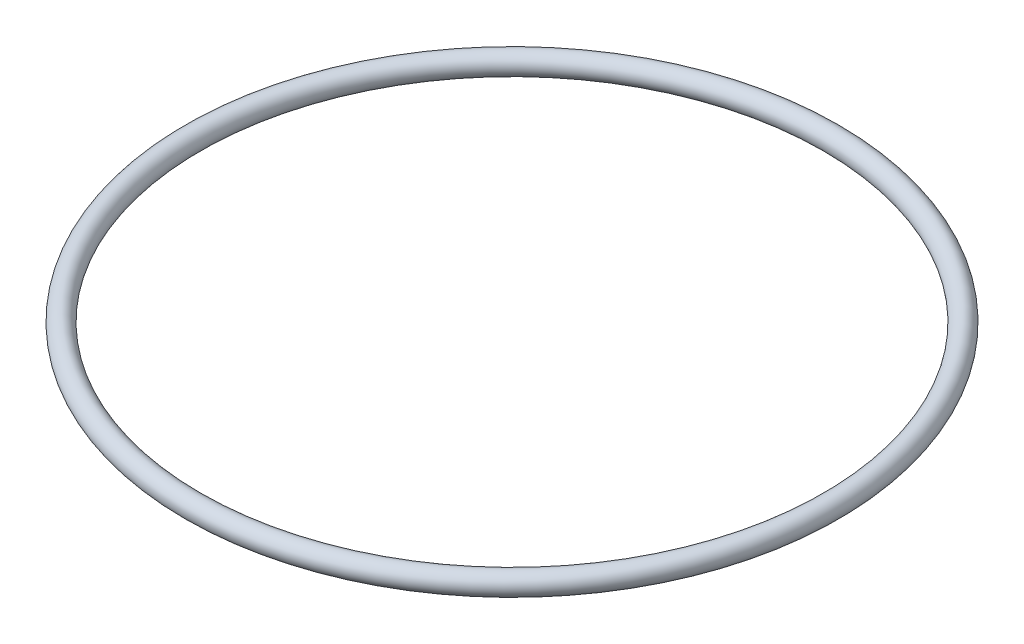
from build123d import *

# Parameters (mm, degrees)
SKETCH1_R = 1.3081


with BuildPart() as part:
    # Sketch1 → Revolve1 (revolve)
    with BuildSketch(Plane.XY, mode=Mode.PRIVATE) as revolve1_sk:
        with Locations((39.243, 0)):
            Circle(SKETCH1_R)
    revolve(revolve1_sk.sketch.rotate(Axis((0, 3.724897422, 0), (0, -1, 0)), 90), axis=Axis((0, 3.724897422, 0), (0, -1, 0)))


solid = part.part
